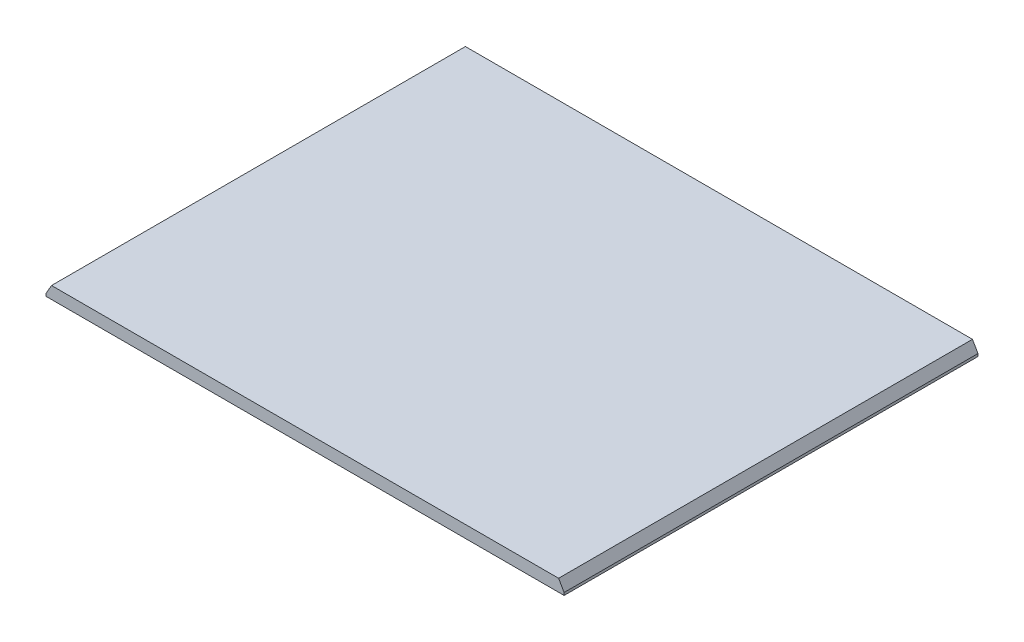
from build123d import *
from OCP.BRepFilletAPI import BRepFilletAPI_MakeChamfer

# Parameters (mm, degrees)
SKETCH3_W           = 1083.083
SKETCH3_H           = 865.2
BOSS_EXTRUDE1_DEPTH = 25.4
CHAMFER1_SIZE       = 20
CHAMFER1_SIZE2      = 11.547005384


with BuildPart() as part:
    # Sketch3 → Boss-Extrude1 (new body)
    with BuildSketch(Plane(origin=(0, 0, 0), x_dir=(-1, 0, 0), z_dir=(0, 1, 0))):
        Rectangle(SKETCH3_W, SKETCH3_H)
    extrude(amount=BOSS_EXTRUDE1_DEPTH)

    # Chamfer1: one chamfer whose edges measure the first distance from different faces: ONE call of the kernel's chamfer builder (chamfer() names one face for all edges)
    chamfer1_edges_1 = [part.edges().sort_by_distance(p)[0] for p in [
        (-541.5415, 25.4, 0),
    ]]
    chamfer1_side_1 = [part.faces().sort_by_distance(p)[0] for p in [
        (-541.5415, 12.7, 0),
    ]]
    chamfer1_edges_2 = [part.edges().sort_by_distance(p)[0] for p in [
        (541.5415, 25.4, 0),
    ]]
    chamfer1_side_2 = [part.faces().sort_by_distance(p)[0] for p in [
        (541.5415, 12.7, 0),
    ]]
    chamfer1 = BRepFilletAPI_MakeChamfer(part.part.solid().wrapped)
    for e in chamfer1_edges_1:
        chamfer1.Add(CHAMFER1_SIZE, CHAMFER1_SIZE2, e.wrapped, chamfer1_side_1[0].wrapped)  # the first distance lies on this face
    for e in chamfer1_edges_2:
        chamfer1.Add(CHAMFER1_SIZE, CHAMFER1_SIZE2, e.wrapped, chamfer1_side_2[0].wrapped)  # the first distance lies on this face
    add(Compound.cast(chamfer1.Shape()), mode=Mode.REPLACE)


solid = part.part
